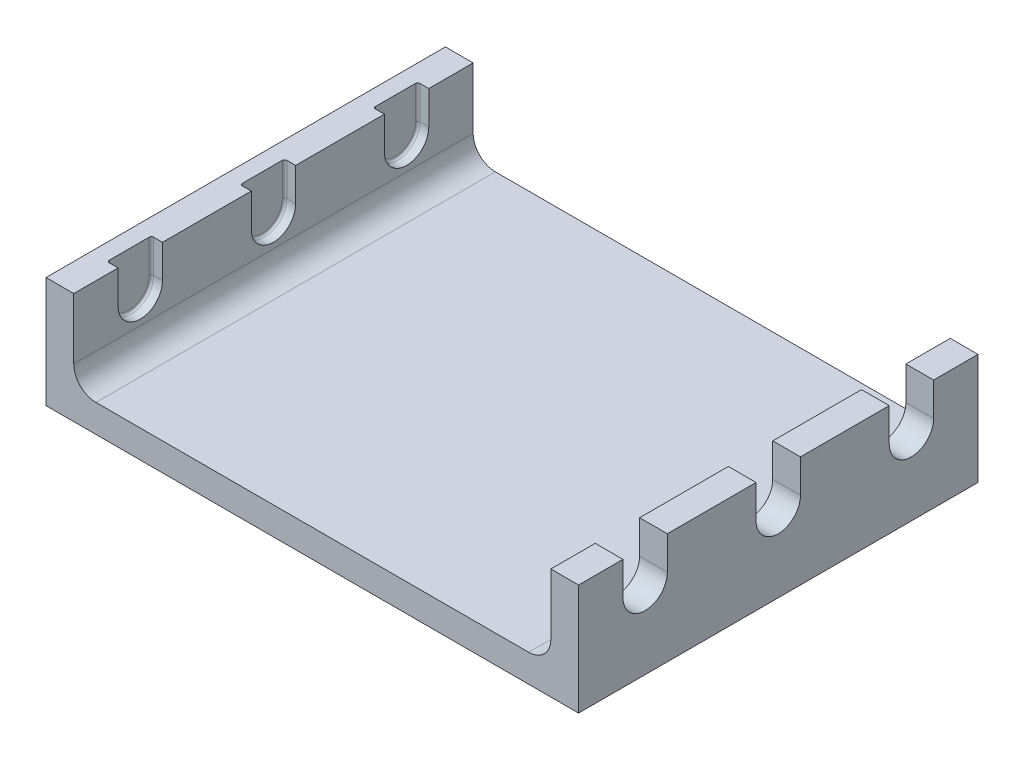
from build123d import *

# Parameters (mm, degrees)
EXTRUDE1_DEPTH     = 76.2
CUT_EXTRUDE1_DEPTH = 12.7
FILLET1_R          = 2.54
CUT_EXTRUDE2_REACH = 629.334
LPATTERN1_COUNT    = 3
LPATTERN1_PITCH    = 152.4


with BuildPart() as part:
    # Sketch1 → Extrude1 (new, symmetric)
    with BuildSketch(Plane.XY):
        with BuildLine():
            Line((273.05, 57.15), (273.05, 127))
            Line((273.05, 127), (304.8, 127))
            Line((304.8, 127), (304.8, 0))
            Line((304.8, 0), (-304.8, 0))
            Line((-304.8, 0), (-304.8, 127))
            Line((-304.8, 127), (-273.05, 127))
            Line((-273.05, 127), (-273.05, 57.15))
            ThreePointArc((-273.05, 57.15), (-265.610512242, 39.189487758), (-247.65, 31.75))
            Line((-247.65, 31.75), (247.65, 31.75))
            ThreePointArc((247.65, 31.75), (265.610512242, 39.189487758), (273.05, 57.15))
        make_face()
    extrude(amount=EXTRUDE1_DEPTH, both=True)

    # Sketch2 → Cut-Extrude1 (cut)
    with BuildSketch(Plane(origin=(-273.05, 0, 0), x_dir=(0, 0, -1), z_dir=(1, 0, 0))):
        with BuildLine():
            Line((-25.4, 127), (-25.4, 88.9))
            ThreePointArc((-25.4, 88.9), (0, 63.5), (25.4, 88.9))
            Line((25.4, 88.9), (25.4, 127))
            Line((25.4, 127), (-25.4, 127))
        make_face()
    extrude(amount=-CUT_EXTRUDE1_DEPTH, mode=Mode.SUBTRACT)

    # Fillet1
    fillet1_edges = [part.edges().sort_by_distance(p)[0] for p in [
        (-285.75, 107.95, -25.4),
        (-285.75, 63.5, 0),
        (-285.75, 107.95, 25.4),
    ]]
    fillet(fillet1_edges, radius=FILLET1_R)

    # Sketch3 → Cut-Extrude2 (cut, up to next)
    with BuildSketch(Plane(origin=(304.8, 0, 0), x_dir=(0, 0, -1), z_dir=(1, 0, 0)), mode=Mode.PRIVATE) as cut_extrude2_sk1:
        with BuildLine():
            Line((-25.4, 127), (-25.4, 88.9))
            ThreePointArc((-25.4, 88.9), (0, 63.5), (25.4, 88.9))
            Line((25.4, 88.9), (25.4, 127))
            Line((25.4, 127), (-25.4, 127))
        make_face()
    cut_extrude2_tool1 = extrude(cut_extrude2_sk1.sketch, amount=-CUT_EXTRUDE2_REACH, mode=Mode.PRIVATE) & part.part
    add(cut_extrude2_tool1.solids().sort_by_distance((304.8, 97.698613, 0))[0], mode=Mode.SUBTRACT)


with BuildPart() as lpattern1_1:
    # LPattern1: pattern copy
    add(part.part.moved(Location(Vector(0, 0, -1) * (1 * LPATTERN1_PITCH))))


with BuildPart() as lpattern1_2:
    # LPattern1: pattern copy
    add(part.part.moved(Location(Vector(0, 0, -1) * (2 * LPATTERN1_PITCH))))


with BuildPart() as part_1:
    add(part.part)

    # Combine1: union LPattern1_1, LPattern1_2
    add(lpattern1_1.part)
    add(lpattern1_2.part)


solid = part_1.part
